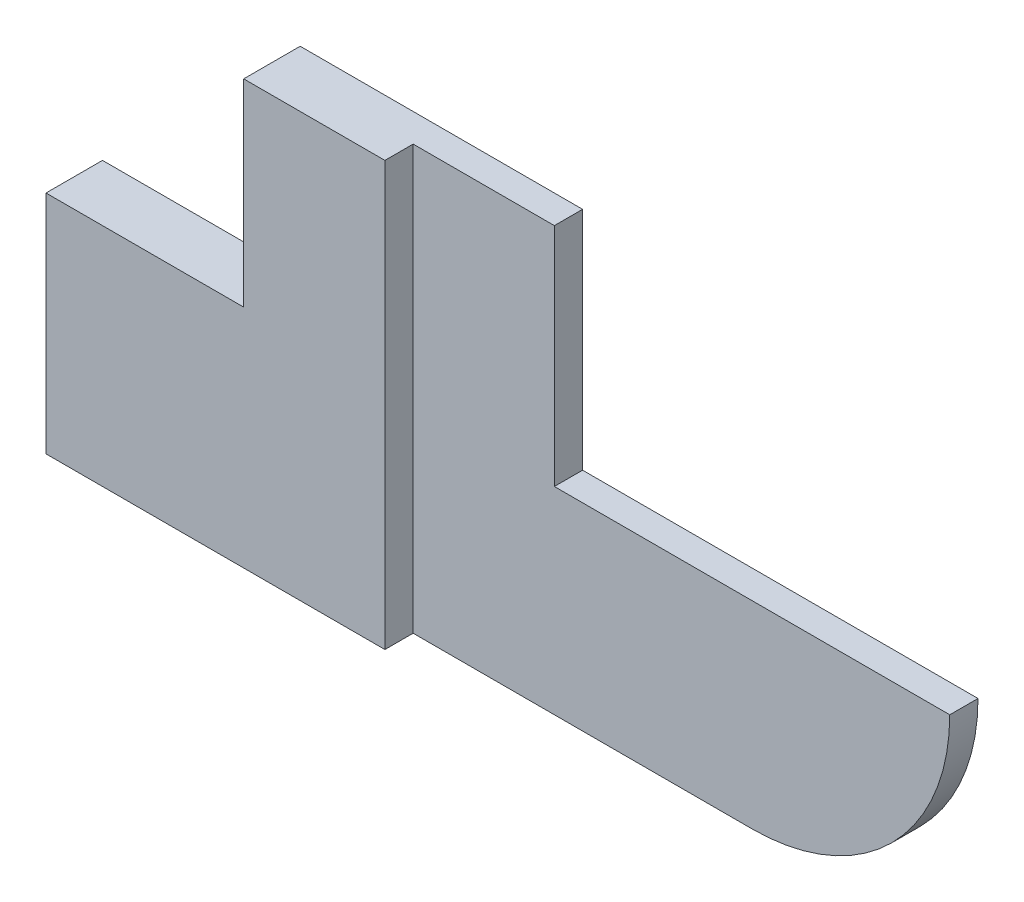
from build123d import *

# Parameters (mm, degrees)
EXTRUDE1_DEPTH     = 10
SKETCH2_W          = 95
SKETCH2_H          = 75
CUT_EXTRUDE1_DEPTH = 5


with BuildPart() as part:
    # Sketch1 → Extrude1 (new body)
    with BuildSketch(Plane.XY):
        with BuildLine():
            Line((0, 0), (0, 40))
            Line((0, 40), (35, 40))
            Line((35, 40), (35, 75))
            Line((35, 75), (85, 75))
            Line((85, 75), (85, 35))
            Line((85, 35), (155, 35))
            ThreePointArc((155, 35), (144.748737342, 10.251262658), (120, 0))
            Line((120, 0), (0, 0))
        make_face()
    extrude(amount=EXTRUDE1_DEPTH)

    # Sketch2 → Cut-Extrude1 (cut)
    with BuildSketch(Plane.XY.offset(10)):
        with Locations((107.5, 37.5)):
            Rectangle(SKETCH2_W, SKETCH2_H)
    extrude(amount=-CUT_EXTRUDE1_DEPTH, mode=Mode.SUBTRACT)


solid = part.part
